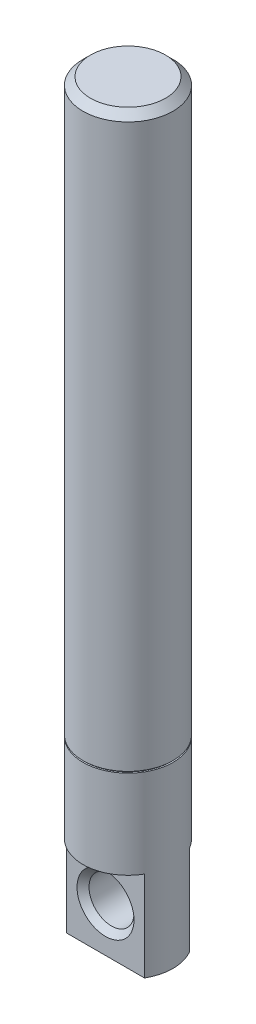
ISO-10303-21;
HEADER;
FILE_DESCRIPTION(('STEP AP214'),'2;1');
FILE_NAME('part.step','',(''),(''),'','','');
FILE_SCHEMA(('AUTOMOTIVE_DESIGN { 1 0 10303 214 1 1 1 1 }'));
ENDSEC;
DATA;
#1=APPLICATION_CONTEXT('core data for automotive mechanical design processes');
#2=APPLICATION_PROTOCOL_DEFINITION('international standard','automotive_design',2000,#1);
#3=PRODUCT_CONTEXT('',#1,'mechanical');
#4=PRODUCT('Part','Part','',(#3));
#5=PRODUCT_RELATED_PRODUCT_CATEGORY('part','',(#4));
#6=PRODUCT_DEFINITION_FORMATION('','',#4);
#7=PRODUCT_DEFINITION_CONTEXT('part definition',#1,'design');
#8=PRODUCT_DEFINITION('design','',#6,#7);
#9=PRODUCT_DEFINITION_SHAPE('','',#8);
#10=(LENGTH_UNIT() NAMED_UNIT(*) SI_UNIT(.MILLI.,.METRE.));
#11=(NAMED_UNIT(*) PLANE_ANGLE_UNIT() SI_UNIT($,.RADIAN.));
#12=(NAMED_UNIT(*) SI_UNIT($,.STERADIAN.) SOLID_ANGLE_UNIT());
#13=UNCERTAINTY_MEASURE_WITH_UNIT(LENGTH_MEASURE(1.E-05),#10,'distance_accuracy_value','');
#14=(GEOMETRIC_REPRESENTATION_CONTEXT(3) GLOBAL_UNCERTAINTY_ASSIGNED_CONTEXT((#13)) GLOBAL_UNIT_ASSIGNED_CONTEXT((#10,
#11,#12)) REPRESENTATION_CONTEXT('',''));
#15=CARTESIAN_POINT('',(0.,0.,0.));
#16=DIRECTION('',(0.,0.,1.));
#17=DIRECTION('',(1.,0.,0.));
#18=AXIS2_PLACEMENT_3D('',#15,#16,#17);
#19=CARTESIAN_POINT('',(0.,25.,0.));
#20=DIRECTION('',(0.,-1.,0.));
#21=DIRECTION('',(0.,0.,-1.));
#22=AXIS2_PLACEMENT_3D('',#19,#20,#21);
#23=CYLINDRICAL_SURFACE('',#22,1.5);
#24=CARTESIAN_POINT('',(0.,6.,0.));
#25=DIRECTION('',(0.,1.,0.));
#26=DIRECTION('',(0.,0.,1.));
#27=AXIS2_PLACEMENT_3D('',#24,#25,#26);
#28=CIRCLE('',#27,1.5);
#29=CARTESIAN_POINT('',(0.,6.,1.5));
#30=VERTEX_POINT('',#29);
#31=EDGE_CURVE('E113',#30,#30,#28,.T.);
#32=ORIENTED_EDGE('',*,*,#31,.T.);
#33=EDGE_LOOP('',(#32));
#34=FACE_BOUND('',#33,.T.);
#35=CARTESIAN_POINT('',(0.,24.75,0.));
#36=DIRECTION('',(0.,1.,0.));
#37=DIRECTION('',(0.,0.,1.));
#38=AXIS2_PLACEMENT_3D('',#35,#36,#37);
#39=CIRCLE('',#38,1.5);
#40=CARTESIAN_POINT('',(0.,24.75,1.5));
#41=VERTEX_POINT('',#40);
#42=EDGE_CURVE('E109',#41,#41,#39,.F.);
#43=ORIENTED_EDGE('',*,*,#42,.T.);
#44=EDGE_LOOP('',(#43));
#45=FACE_BOUND('',#44,.T.);
#46=ADVANCED_FACE('F42',(#34,#45),#23,.T.);
#47=CARTESIAN_POINT('',(0.,25.,0.));
#48=DIRECTION('',(0.,1.,0.));
#49=DIRECTION('',(0.,0.,1.));
#50=AXIS2_PLACEMENT_3D('',#47,#48,#49);
#51=PLANE('',#50);
#52=CARTESIAN_POINT('',(0.,25.,0.));
#53=DIRECTION('',(0.,1.,0.));
#54=DIRECTION('',(0.,0.,1.));
#55=AXIS2_PLACEMENT_3D('',#52,#53,#54);
#56=CIRCLE('',#55,1.25);
#57=CARTESIAN_POINT('',(0.,25.,1.25));
#58=VERTEX_POINT('',#57);
#59=EDGE_CURVE('E101',#58,#58,#56,.T.);
#60=ORIENTED_EDGE('',*,*,#59,.T.);
#61=EDGE_LOOP('',(#60));
#62=FACE_BOUND('',#61,.T.);
#63=ADVANCED_FACE('F172',(#62),#51,.T.);
#64=CARTESIAN_POINT('',(0.,25.,0.));
#65=DIRECTION('',(0.,-1.,0.));
#66=DIRECTION('',(0.,0.,-1.));
#67=AXIS2_PLACEMENT_3D('',#64,#65,#66);
#68=CONICAL_SURFACE('',#67,1.25,0.785398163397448);
#69=ORIENTED_EDGE('',*,*,#42,.F.);
#70=EDGE_LOOP('',(#69));
#71=FACE_BOUND('',#70,.T.);
#72=ORIENTED_EDGE('',*,*,#59,.F.);
#73=EDGE_LOOP('',(#72));
#74=FACE_BOUND('',#73,.T.);
#75=ADVANCED_FACE('F175',(#71,#74),#68,.T.);
#76=CARTESIAN_POINT('',(1.45,5.95,0.));
#77=DIRECTION('',(0.,-1.,0.));
#78=DIRECTION('',(0.,0.,-1.));
#79=AXIS2_PLACEMENT_3D('',#76,#77,#78);
#80=PLANE('',#79);
#81=CARTESIAN_POINT('',(0.,5.95,0.));
#82=DIRECTION('',(0.,-1.,0.));
#83=DIRECTION('',(0.,0.,-1.));
#84=AXIS2_PLACEMENT_3D('',#81,#82,#83);
#85=CIRCLE('',#84,1.45);
#86=CARTESIAN_POINT('',(0.,5.95,-1.45));
#87=VERTEX_POINT('',#86);
#88=EDGE_CURVE('E116',#87,#87,#85,.T.);
#89=ORIENTED_EDGE('',*,*,#88,.T.);
#90=EDGE_LOOP('',(#89));
#91=FACE_BOUND('',#90,.T.);
#92=CARTESIAN_POINT('',(0.,5.95,0.));
#93=DIRECTION('',(0.,-1.,0.));
#94=DIRECTION('',(0.,0.,-1.));
#95=AXIS2_PLACEMENT_3D('',#92,#93,#94);
#96=CIRCLE('',#95,1.5);
#97=CARTESIAN_POINT('',(0.,5.95,-1.5));
#98=VERTEX_POINT('',#97);
#99=EDGE_CURVE('E90',#98,#98,#96,.T.);
#100=ORIENTED_EDGE('',*,*,#99,.F.);
#101=EDGE_LOOP('',(#100));
#102=FACE_BOUND('',#101,.T.);
#103=ADVANCED_FACE('F166',(#91,#102),#80,.F.);
#104=CARTESIAN_POINT('',(1.45,6.,0.));
#105=DIRECTION('',(0.,1.,0.));
#106=DIRECTION('',(0.,0.,1.));
#107=AXIS2_PLACEMENT_3D('',#104,#105,#106);
#108=PLANE('',#107);
#109=CARTESIAN_POINT('',(0.,6.,0.));
#110=DIRECTION('',(0.,-1.,0.));
#111=DIRECTION('',(0.,0.,-1.));
#112=AXIS2_PLACEMENT_3D('',#109,#110,#111);
#113=CIRCLE('',#112,1.45);
#114=CARTESIAN_POINT('',(0.,6.,-1.45));
#115=VERTEX_POINT('',#114);
#116=EDGE_CURVE('E157',#115,#115,#113,.T.);
#117=ORIENTED_EDGE('',*,*,#116,.F.);
#118=EDGE_LOOP('',(#117));
#119=FACE_BOUND('',#118,.T.);
#120=ORIENTED_EDGE('',*,*,#31,.F.);
#121=EDGE_LOOP('',(#120));
#122=FACE_BOUND('',#121,.T.);
#123=ADVANCED_FACE('F163',(#119,#122),#108,.F.);
#124=CARTESIAN_POINT('',(0.,0.,0.));
#125=DIRECTION('',(0.,-1.,0.));
#126=DIRECTION('',(0.,0.,-1.));
#127=AXIS2_PLACEMENT_3D('',#124,#125,#126);
#128=CYLINDRICAL_SURFACE('',#127,1.45);
#129=ORIENTED_EDGE('',*,*,#88,.F.);
#130=EDGE_LOOP('',(#129));
#131=FACE_BOUND('',#130,.T.);
#132=ORIENTED_EDGE('',*,*,#116,.T.);
#133=EDGE_LOOP('',(#132));
#134=FACE_BOUND('',#133,.T.);
#135=ADVANCED_FACE('F161',(#131,#134),#128,.T.);
#136=CARTESIAN_POINT('',(0.,3.,0.));
#137=DIRECTION('',(0.,-1.,0.));
#138=DIRECTION('',(0.,0.,-1.));
#139=AXIS2_PLACEMENT_3D('',#136,#137,#138);
#140=PLANE('',#139);
#141=CARTESIAN_POINT('',(0.,3.,0.));
#142=DIRECTION('',(0.,-1.,0.));
#143=DIRECTION('',(0.,0.,-1.));
#144=AXIS2_PLACEMENT_3D('',#141,#142,#143);
#145=CIRCLE('',#144,1.5);
#146=CARTESIAN_POINT('',(-1.29903810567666,3.,-0.75));
#147=VERTEX_POINT('',#146);
#148=CARTESIAN_POINT('',(1.29903810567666,3.,-0.75));
#149=VERTEX_POINT('',#148);
#150=EDGE_CURVE('E143',#147,#149,#145,.T.);
#151=ORIENTED_EDGE('',*,*,#150,.T.);
#152=DIRECTION('',(-1.,0.,0.));
#153=VECTOR('',#152,1.);
#154=CARTESIAN_POINT('',(1.29903810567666,3.,-0.75));
#155=LINE('',#154,#153);
#156=EDGE_CURVE('E147',#149,#147,#155,.T.);
#157=ORIENTED_EDGE('',*,*,#156,.T.);
#158=EDGE_LOOP('',(#151,#157));
#159=FACE_BOUND('',#158,.T.);
#160=ADVANCED_FACE('F139',(#159),#140,.T.);
#161=CARTESIAN_POINT('',(1.29903810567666,3.,-0.75));
#162=DIRECTION('',(0.,0.,1.));
#163=DIRECTION('',(1.,0.,0.));
#164=AXIS2_PLACEMENT_3D('',#161,#162,#163);
#165=PLANE('',#164);
#166=CARTESIAN_POINT('',(0.,1.5,-0.75));
#167=DIRECTION('',(0.,0.,1.));
#168=DIRECTION('',(1.,0.,0.));
#169=AXIS2_PLACEMENT_3D('',#166,#167,#168);
#170=CIRCLE('',#169,0.95);
#171=CARTESIAN_POINT('',(0.95,1.5,-0.75));
#172=VERTEX_POINT('',#171);
#173=EDGE_CURVE('E112',#172,#172,#170,.T.);
#174=ORIENTED_EDGE('',*,*,#173,.T.);
#175=EDGE_LOOP('',(#174));
#176=FACE_BOUND('',#175,.T.);
#177=DIRECTION('',(-1.,0.,0.));
#178=VECTOR('',#177,1.);
#179=CARTESIAN_POINT('',(1.29903810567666,0.,-0.75));
#180=LINE('',#179,#178);
#181=CARTESIAN_POINT('',(1.29903810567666,0.,-0.75));
#182=VERTEX_POINT('',#181);
#183=CARTESIAN_POINT('',(-1.29903810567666,0.,-0.75));
#184=VERTEX_POINT('',#183);
#185=EDGE_CURVE('E94',#182,#184,#180,.T.);
#186=ORIENTED_EDGE('',*,*,#185,.T.);
#187=DIRECTION('',(0.,-1.,0.));
#188=VECTOR('',#187,1.);
#189=CARTESIAN_POINT('',(-1.29903810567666,3.,-0.75));
#190=LINE('',#189,#188);
#191=EDGE_CURVE('E99',#147,#184,#190,.T.);
#192=ORIENTED_EDGE('',*,*,#191,.F.);
#193=ORIENTED_EDGE('',*,*,#156,.F.);
#194=DIRECTION('',(0.,-1.,0.));
#195=VECTOR('',#194,1.);
#196=CARTESIAN_POINT('',(1.29903810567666,3.,-0.75));
#197=LINE('',#196,#195);
#198=EDGE_CURVE('E103',#149,#182,#197,.T.);
#199=ORIENTED_EDGE('',*,*,#198,.T.);
#200=EDGE_LOOP('',(#186,#192,#193,#199));
#201=FACE_BOUND('',#200,.T.);
#202=ADVANCED_FACE('F136',(#176,#201),#165,.F.);
#203=CARTESIAN_POINT('',(0.,0.,0.));
#204=DIRECTION('',(0.,1.,0.));
#205=DIRECTION('',(0.,0.,1.));
#206=AXIS2_PLACEMENT_3D('',#203,#204,#205);
#207=PLANE('',#206);
#208=DIRECTION('',(-1.,0.,0.));
#209=VECTOR('',#208,1.);
#210=CARTESIAN_POINT('',(1.29903810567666,0.,0.75));
#211=LINE('',#210,#209);
#212=CARTESIAN_POINT('',(1.29903810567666,0.,0.75));
#213=VERTEX_POINT('',#212);
#214=CARTESIAN_POINT('',(-1.29903810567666,0.,0.75));
#215=VERTEX_POINT('',#214);
#216=EDGE_CURVE('E82',#213,#215,#211,.T.);
#217=ORIENTED_EDGE('',*,*,#216,.T.);
#218=CARTESIAN_POINT('',(0.,0.,0.));
#219=DIRECTION('',(0.,1.,0.));
#220=DIRECTION('',(0.,0.,1.));
#221=AXIS2_PLACEMENT_3D('',#218,#219,#220);
#222=CIRCLE('',#221,1.5);
#223=EDGE_CURVE('E98',#184,#215,#222,.T.);
#224=ORIENTED_EDGE('',*,*,#223,.F.);
#225=ORIENTED_EDGE('',*,*,#185,.F.);
#226=EDGE_CURVE('E64',#213,#182,#222,.T.);
#227=ORIENTED_EDGE('',*,*,#226,.F.);
#228=EDGE_LOOP('',(#217,#224,#225,#227));
#229=FACE_BOUND('',#228,.T.);
#230=ADVANCED_FACE('F97',(#229),#207,.F.);
#231=CARTESIAN_POINT('',(0.,3.,0.));
#232=DIRECTION('',(0.,-1.,0.));
#233=DIRECTION('',(0.,0.,1.));
#234=AXIS2_PLACEMENT_3D('',#231,#232,#233);
#235=PLANE('',#234);
#236=CARTESIAN_POINT('',(0.,3.,0.));
#237=DIRECTION('',(0.,1.,0.));
#238=DIRECTION('',(0.,0.,1.));
#239=AXIS2_PLACEMENT_3D('',#236,#237,#238);
#240=CIRCLE('',#239,1.5);
#241=CARTESIAN_POINT('',(-1.29903810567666,3.,0.75));
#242=VERTEX_POINT('',#241);
#243=CARTESIAN_POINT('',(1.29903810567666,3.,0.75));
#244=VERTEX_POINT('',#243);
#245=EDGE_CURVE('E89',#242,#244,#240,.T.);
#246=ORIENTED_EDGE('',*,*,#245,.F.);
#247=DIRECTION('',(-1.,0.,0.));
#248=VECTOR('',#247,1.);
#249=CARTESIAN_POINT('',(1.29903810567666,3.,0.75));
#250=LINE('',#249,#248);
#251=EDGE_CURVE('E151',#244,#242,#250,.T.);
#252=ORIENTED_EDGE('',*,*,#251,.F.);
#253=EDGE_LOOP('',(#246,#252));
#254=FACE_BOUND('',#253,.T.);
#255=ADVANCED_FACE('F186',(#254),#235,.T.);
#256=CARTESIAN_POINT('',(1.29903810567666,3.,0.75));
#257=DIRECTION('',(0.,0.,1.));
#258=DIRECTION('',(1.,0.,0.));
#259=AXIS2_PLACEMENT_3D('',#256,#257,#258);
#260=PLANE('',#259);
#261=CARTESIAN_POINT('',(0.,1.5,0.75));
#262=DIRECTION('',(0.,0.,1.));
#263=DIRECTION('',(1.,0.,0.));
#264=AXIS2_PLACEMENT_3D('',#261,#262,#263);
#265=CIRCLE('',#264,0.95);
#266=CARTESIAN_POINT('',(0.95,1.5,0.75));
#267=VERTEX_POINT('',#266);
#268=EDGE_CURVE('E13',#267,#267,#265,.F.);
#269=ORIENTED_EDGE('',*,*,#268,.T.);
#270=EDGE_LOOP('',(#269));
#271=FACE_BOUND('',#270,.T.);
#272=ORIENTED_EDGE('',*,*,#216,.F.);
#273=DIRECTION('',(0.,-1.,0.));
#274=VECTOR('',#273,1.);
#275=CARTESIAN_POINT('',(1.29903810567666,3.,0.75));
#276=LINE('',#275,#274);
#277=EDGE_CURVE('E84',#244,#213,#276,.T.);
#278=ORIENTED_EDGE('',*,*,#277,.F.);
#279=ORIENTED_EDGE('',*,*,#251,.T.);
#280=DIRECTION('',(0.,-1.,0.));
#281=VECTOR('',#280,1.);
#282=CARTESIAN_POINT('',(-1.29903810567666,3.,0.75));
#283=LINE('',#282,#281);
#284=EDGE_CURVE('E56',#242,#215,#283,.T.);
#285=ORIENTED_EDGE('',*,*,#284,.T.);
#286=EDGE_LOOP('',(#272,#278,#279,#285));
#287=FACE_BOUND('',#286,.T.);
#288=ADVANCED_FACE('F83',(#271,#287),#260,.T.);
#289=ORIENTED_EDGE('',*,*,#99,.T.);
#290=EDGE_LOOP('',(#289));
#291=FACE_BOUND('',#290,.T.);
#292=ORIENTED_EDGE('',*,*,#284,.F.);
#293=ORIENTED_EDGE('',*,*,#245,.T.);
#294=ORIENTED_EDGE('',*,*,#277,.T.);
#295=ORIENTED_EDGE('',*,*,#226,.T.);
#296=ORIENTED_EDGE('',*,*,#198,.F.);
#297=ORIENTED_EDGE('',*,*,#150,.F.);
#298=ORIENTED_EDGE('',*,*,#191,.T.);
#299=ORIENTED_EDGE('',*,*,#223,.T.);
#300=EDGE_LOOP('',(#292,#293,#294,#295,#296,#297,#298,#299));
#301=FACE_BOUND('',#300,.T.);
#302=ADVANCED_FACE('F92',(#291,#301),#23,.T.);
#303=CARTESIAN_POINT('',(0.,1.5,-1.5));
#304=DIRECTION('',(0.,0.,1.));
#305=DIRECTION('',(1.,0.,0.));
#306=AXIS2_PLACEMENT_3D('',#303,#304,#305);
#307=CYLINDRICAL_SURFACE('',#306,0.75);
#308=CARTESIAN_POINT('',(0.,1.5,-0.549999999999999));
#309=DIRECTION('',(0.,0.,1.));
#310=DIRECTION('',(1.,0.,0.));
#311=AXIS2_PLACEMENT_3D('',#308,#309,#310);
#312=CIRCLE('',#311,0.75);
#313=CARTESIAN_POINT('',(0.75,1.5,-0.549999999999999));
#314=VERTEX_POINT('',#313);
#315=EDGE_CURVE('E49',#314,#314,#312,.F.);
#316=ORIENTED_EDGE('',*,*,#315,.T.);
#317=EDGE_LOOP('',(#316));
#318=FACE_BOUND('',#317,.T.);
#319=CARTESIAN_POINT('',(0.,1.5,0.550000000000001));
#320=DIRECTION('',(0.,0.,1.));
#321=DIRECTION('',(1.,0.,0.));
#322=AXIS2_PLACEMENT_3D('',#319,#320,#321);
#323=CIRCLE('',#322,0.75);
#324=CARTESIAN_POINT('',(0.75,1.5,0.550000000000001));
#325=VERTEX_POINT('',#324);
#326=EDGE_CURVE('E121',#325,#325,#323,.T.);
#327=ORIENTED_EDGE('',*,*,#326,.T.);
#328=EDGE_LOOP('',(#327));
#329=FACE_BOUND('',#328,.T.);
#330=ADVANCED_FACE('F126',(#318,#329),#307,.F.);
#331=CARTESIAN_POINT('',(0.,1.5,-0.75));
#332=DIRECTION('',(0.,0.,-1.));
#333=DIRECTION('',(-1.,0.,0.));
#334=AXIS2_PLACEMENT_3D('',#331,#332,#333);
#335=CONICAL_SURFACE('',#334,0.95,0.785398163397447);
#336=ORIENTED_EDGE('',*,*,#315,.F.);
#337=EDGE_LOOP('',(#336));
#338=FACE_BOUND('',#337,.T.);
#339=ORIENTED_EDGE('',*,*,#173,.F.);
#340=EDGE_LOOP('',(#339));
#341=FACE_BOUND('',#340,.T.);
#342=ADVANCED_FACE('F129',(#338,#341),#335,.F.);
#343=CARTESIAN_POINT('',(0.,1.5,0.550000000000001));
#344=DIRECTION('',(0.,0.,1.));
#345=DIRECTION('',(1.,0.,0.));
#346=AXIS2_PLACEMENT_3D('',#343,#344,#345);
#347=CONICAL_SURFACE('',#346,0.75,0.78539816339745);
#348=CARTESIAN_POINT('',(0.95,1.5,0.75));
#349=CARTESIAN_POINT('',(0.947916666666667,1.5,0.747916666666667));
#350=CARTESIAN_POINT('',(0.945833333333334,1.5,0.745833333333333));
#351=CARTESIAN_POINT('',(0.941666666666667,1.5,0.741666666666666));
#352=CARTESIAN_POINT('',(0.939583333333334,1.5,0.739583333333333));
#353=CARTESIAN_POINT('',(0.935416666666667,1.5,0.735416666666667));
#354=CARTESIAN_POINT('',(0.933333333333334,1.5,0.733333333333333));
#355=CARTESIAN_POINT('',(0.929166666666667,1.5,0.729166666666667));
#356=CARTESIAN_POINT('',(0.927083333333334,1.5,0.727083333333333));
#357=CARTESIAN_POINT('',(0.922916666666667,1.5,0.722916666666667));
#358=CARTESIAN_POINT('',(0.920833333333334,1.5,0.720833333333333));
#359=CARTESIAN_POINT('',(0.916666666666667,1.5,0.716666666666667));
#360=CARTESIAN_POINT('',(0.914583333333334,1.5,0.714583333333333));
#361=CARTESIAN_POINT('',(0.910416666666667,1.5,0.710416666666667));
#362=CARTESIAN_POINT('',(0.908333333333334,1.5,0.708333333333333));
#363=CARTESIAN_POINT('',(0.904166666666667,1.5,0.704166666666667));
#364=CARTESIAN_POINT('',(0.902083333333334,1.5,0.702083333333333));
#365=CARTESIAN_POINT('',(0.897916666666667,1.5,0.697916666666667));
#366=CARTESIAN_POINT('',(0.895833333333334,1.5,0.695833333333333));
#367=CARTESIAN_POINT('',(0.891666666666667,1.5,0.691666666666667));
#368=CARTESIAN_POINT('',(0.889583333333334,1.5,0.689583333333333));
#369=CARTESIAN_POINT('',(0.885416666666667,1.5,0.685416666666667));
#370=CARTESIAN_POINT('',(0.883333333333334,1.5,0.683333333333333));
#371=CARTESIAN_POINT('',(0.879166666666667,1.5,0.679166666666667));
#372=CARTESIAN_POINT('',(0.877083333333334,1.5,0.677083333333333));
#373=CARTESIAN_POINT('',(0.872916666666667,1.5,0.672916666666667));
#374=CARTESIAN_POINT('',(0.870833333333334,1.5,0.670833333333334));
#375=CARTESIAN_POINT('',(0.866666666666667,1.5,0.666666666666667));
#376=CARTESIAN_POINT('',(0.864583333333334,1.5,0.664583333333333));
#377=CARTESIAN_POINT('',(0.860416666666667,1.5,0.660416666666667));
#378=CARTESIAN_POINT('',(0.858333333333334,1.5,0.658333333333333));
#379=CARTESIAN_POINT('',(0.854166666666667,1.5,0.654166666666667));
#380=CARTESIAN_POINT('',(0.852083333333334,1.5,0.652083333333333));
#381=CARTESIAN_POINT('',(0.847916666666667,1.5,0.647916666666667));
#382=CARTESIAN_POINT('',(0.845833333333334,1.5,0.645833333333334));
#383=CARTESIAN_POINT('',(0.841666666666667,1.5,0.641666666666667));
#384=CARTESIAN_POINT('',(0.839583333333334,1.5,0.639583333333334));
#385=CARTESIAN_POINT('',(0.835416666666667,1.5,0.635416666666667));
#386=CARTESIAN_POINT('',(0.833333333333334,1.5,0.633333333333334));
#387=CARTESIAN_POINT('',(0.829166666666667,1.5,0.629166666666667));
#388=CARTESIAN_POINT('',(0.827083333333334,1.5,0.627083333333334));
#389=CARTESIAN_POINT('',(0.822916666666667,1.5,0.622916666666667));
#390=CARTESIAN_POINT('',(0.820833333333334,1.5,0.620833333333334));
#391=CARTESIAN_POINT('',(0.816666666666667,1.5,0.616666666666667));
#392=CARTESIAN_POINT('',(0.814583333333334,1.5,0.614583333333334));
#393=CARTESIAN_POINT('',(0.810416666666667,1.5,0.610416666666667));
#394=CARTESIAN_POINT('',(0.808333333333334,1.5,0.608333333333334));
#395=CARTESIAN_POINT('',(0.804166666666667,1.5,0.604166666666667));
#396=CARTESIAN_POINT('',(0.802083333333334,1.5,0.602083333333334));
#397=CARTESIAN_POINT('',(0.797916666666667,1.5,0.597916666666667));
#398=CARTESIAN_POINT('',(0.795833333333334,1.5,0.595833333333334));
#399=CARTESIAN_POINT('',(0.791666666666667,1.5,0.591666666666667));
#400=CARTESIAN_POINT('',(0.789583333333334,1.5,0.589583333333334));
#401=CARTESIAN_POINT('',(0.785416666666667,1.5,0.585416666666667));
#402=CARTESIAN_POINT('',(0.783333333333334,1.5,0.583333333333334));
#403=CARTESIAN_POINT('',(0.779166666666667,1.5,0.579166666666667));
#404=CARTESIAN_POINT('',(0.777083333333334,1.5,0.577083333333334));
#405=CARTESIAN_POINT('',(0.772916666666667,1.5,0.572916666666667));
#406=CARTESIAN_POINT('',(0.770833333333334,1.5,0.570833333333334));
#407=CARTESIAN_POINT('',(0.766666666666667,1.5,0.566666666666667));
#408=CARTESIAN_POINT('',(0.764583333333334,1.5,0.564583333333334));
#409=CARTESIAN_POINT('',(0.760416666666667,1.5,0.560416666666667));
#410=CARTESIAN_POINT('',(0.758333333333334,1.5,0.558333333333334));
#411=CARTESIAN_POINT('',(0.754166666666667,1.5,0.554166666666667));
#412=CARTESIAN_POINT('',(0.752083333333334,1.5,0.552083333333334));
#413=CARTESIAN_POINT('',(0.75,1.5,0.550000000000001));
#414=B_SPLINE_CURVE_WITH_KNOTS('',3,(#348,#349,#350,#351,#352,#353,#354,#355,#356,#357,#358,
#359,#360,#361,#362,#363,#364,#365,#366,#367,#368,#369,#370,#371,#372,#373,#374,#375,#376,#377,
#378,#379,#380,#381,#382,#383,#384,#385,#386,#387,#388,#389,#390,#391,#392,#393,#394,#395,#396,
#397,#398,#399,#400,#401,#402,#403,#404,#405,#406,#407,#408,#409,#410,#411,#412,#413),
.UNSPECIFIED.,.F.,.F.,(4,2,2,2,2,2,2,2,2,2,2,2,2,2,2,2,2,2,2,2,2,2,2,2,2,2,2,2,2,2,2,2,4),(0.,
0.00883883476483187,0.0176776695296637,0.0265165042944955,0.0353553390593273,0.0441941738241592,
0.053033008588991,0.0618718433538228,0.0707106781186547,0.0795495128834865,0.0883883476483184,
0.0972271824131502,0.106066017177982,0.114904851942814,0.123743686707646,0.132582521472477,
0.141421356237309,0.150260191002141,0.159099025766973,0.167937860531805,0.176776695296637,
0.185615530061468,0.1944543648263,0.203293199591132,0.212132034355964,0.220970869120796,
0.229809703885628,0.238648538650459,0.247487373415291,0.256326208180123,0.265165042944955,
0.274003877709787,0.282842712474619),.UNSPECIFIED.);
#415=EDGE_CURVE('BSEAM132',#267,#325,#414,.T.);
#416=ORIENTED_EDGE('',*,*,#268,.F.);
#417=ORIENTED_EDGE('',*,*,#326,.F.);
#418=ORIENTED_EDGE('',*,*,#415,.T.);
#419=ORIENTED_EDGE('',*,*,#415,.F.);
#420=EDGE_LOOP('',(#416,#418,#417,#419));
#421=FACE_BOUND('',#420,.T.);
#422=ADVANCED_FACE('F132',(#421),#347,.F.);
#423=CLOSED_SHELL('',(#46,#63,#75,#103,#123,#135,#160,#202,#230,#255,#288,#302,#330,#342,#422));
#424=MANIFOLD_SOLID_BREP('B2',#423);
#425=ADVANCED_BREP_SHAPE_REPRESENTATION('',(#18,#424),#14);
#426=SHAPE_DEFINITION_REPRESENTATION(#9,#425);
ENDSEC;
END-ISO-10303-21;
